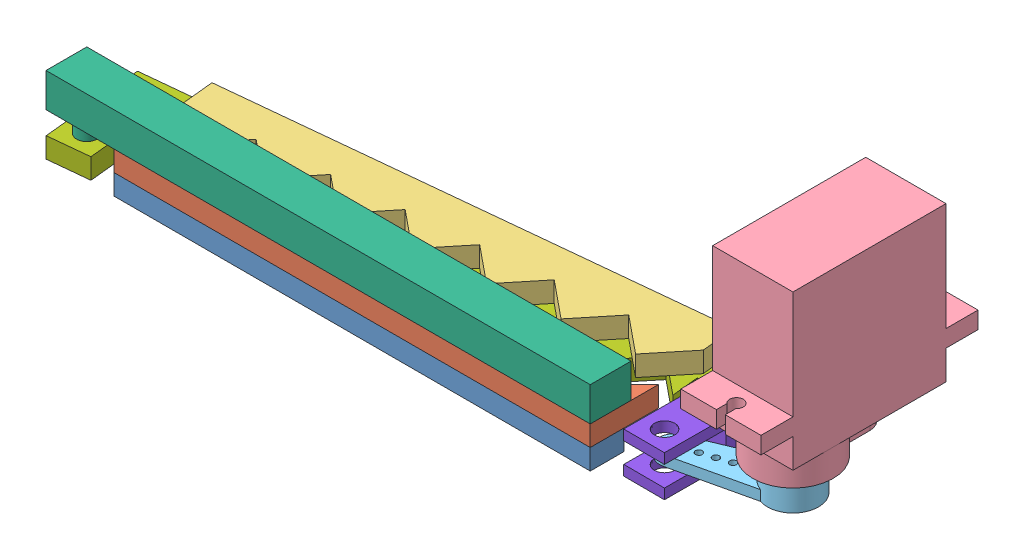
SolidWorks assembly Assem1.SLDASM, configuration Default (file format 10000). Lengths in mm.
Overall size (105.99 34.2 32.49).
9 component instances, 8 part files, 20 mates.
Components (placement in the parent):
- fixed bottom-1: fixed bottom.sldprt [Default] at origin size (70 3 10)
- fixed top-1: fixed top.sldprt [Default] at origin size (70 3 10)
- moving top-1: moving top.sldprt [Default] at (1.9909 0 16.3339) x (0.994925 0 -0.100617) z (0.100617 0 0.994925) size (70 3 10)
- SG60 Servo-1: SG60 Servo.SLDASM [Default] at (88.9 21.35 -16.25) x (0 0 -1) z (-1 0 0) size (31.9 29.9 11.8)
  - Servo-1: Servo.SLDPRT [Default] at origin size (31.9 29.9 11.8)
- Horn Servo-1: Horn Servo.SLDPRT [Default] at (88.9 5.3 -10.9) x (-0.951938 0 0.30629) z (0.30629 0 0.951938) size (19.75 4 7.5)
- holder(just so the mates can exist)-1: holder(just so the mates can exist).sldprt [Default] at (-2.1794 12 0) size (80 11 6)
- Moving Bottm-1: Moving Bottm.sldprt [Default] at (3.621 0 32.4524) x (0.994925 0 -0.100617) z (0.100617 0 0.994925) size (89 3 15)
- Coupler-1: Coupler.sldprt [Default] at (71.6269 8.6082 -7.8987) x (0.999993 0 0.003737) z (-0.003737 0 0.999993) size (6 6 20)
Mates (geometry in assembly coordinates):
- Coincident4: coincident aligned: plane of fixed bottom-1 through (0 3 -5) normal (-1 0 0); plane of fixed top-1 through (0 6 0) normal (-1 0 0)
- Coincident2: coincident anti-aligned: plane of fixed bottom-1 through (0 3 0) normal (0 1 0); plane of fixed top-1 through (0 3 0) normal (0 -1 0)
- Coincident3: coincident aligned: plane of fixed bottom-1 through (0 3 0) normal (0 0 1); plane of fixed top-1 through (0 6 0) normal (0 0 1)
- Coincident11: coincident aligned: plane of fixed top-1 through (0 6 0) normal (0 0 1); plane of holder(just so the mates can exist)-1 through (70 11 0) normal (0 0 1)
- Coincident13: coincident anti-aligned: plane of fixed top-1 through (0 6 0) normal (0 1 0); plane of holder(just so the mates can exist)-1 through (-2.1794 6 0) normal (0 -1 0)
- Coincident17: coincident anti-aligned: plane of moving top-1 through (1.9909 3 16.3339) normal (0 -1 0); plane of Moving Bottm-1 through (3.621 3 32.4524) normal (0 1 0)
- Coincident19: coincident aligned: plane of moving top-1 through (-1.2429 6 -15.6434) normal (-0.994925 0 0.100617); plane of Moving Bottm-1 through (-0.6392 3 -9.6739) normal (-0.994925 0 0.100617)
- Coincident20: coincident aligned: plane of holder(just so the mates can exist)-1 through (-5 0 87.288) normal (0 -1 0); plane of Moving Bottm-1 through (3.621 0 32.4524) normal (0 -1 0)
- Coincident21: coincident aligned: plane of moving top-1 through (-1.2429 6 -15.6434) normal (-0.100617 0 -0.994925); plane of Moving Bottm-1 through (3.7317 3 -16.1465) normal (-0.100617 0 -0.994925)
- Coincident22: coincident aligned: plane of fixed top-1 through (70 6 0) normal (1 0 0); plane of holder(just so the mates can exist)-1 through (70 11 -6) normal (1 0 0)
- Coincident23: coincident aligned: plane of fixed top-1 through (0 6 0) normal (0 0 1); plane of holder(just so the mates can exist)-1 through (70 11 0) normal (0 0 1)
- Coincident24: coincident aligned: cylinder of holder(just so the mates can exist)-1 through (-7 -4.2426 -3) axis (0 1 0) radius 1.5; circle of Moving Bottm-1
- Coincident25: coincident anti-aligned: plane of moving top-1 through (1.9909 6 16.3339) normal (0 1 0); plane of SG60 Servo-1/Servo-1 through (88.9 6 -19.7) normal (0 -1 0)
- Concentric5: concentric anti-aligned: cylinder of Moving Bottm-1 through (74.6732 3 -20.3056) axis (0 -1 0) radius 1.5; cylinder of Coupler-1 through (74.6732 -1.5 -20.3056) axis (0 1 0) radius 1.5
- Coincident26: coincident anti-aligned: plane of Moving Bottm-1 through (3.621 0 32.4524) normal (0 -1 0); plane of Coupler-1 through (77.6508 0 -14.2944) normal (0 1 0)
- Distance2: distance = 5 mm aligned: plane of SG60 Servo-1/Servo-1 through (83 32.7 -5) normal (0 0 1); plane of holder(just so the mates can exist)-1 through (70 11 0) normal (0 0 1)
- Distance1: distance = 13 mm anti-aligned: plane of SG60 Servo-1/Servo-1 through (83 21.35 -16.25) normal (-1 0 0); plane of holder(just so the mates can exist)-1 through (70 11 -6) normal (1 0 0)
- Concentric1: concentric aligned: cylinder of SG60 Servo-1/Servo-1 through (88.9 2.8 -10.9) axis (0 1 0) radius 2.3; cylinder of Horn Servo-1 through (88.9 2.8 -10.9) axis (0 1 0) radius 2.3
- Coincident1: coincident anti-aligned: plane of SG60 Servo-1/Servo-1 through (88.9 2.8 -10.9) normal (0 -1 0); plane of Horn Servo-1 through (88.9 2.8 -10.9) normal (0 1 0)
- Concentric7: concentric anti-aligned: cylinder of Horn Servo-1 through (74.6209 2.8 -6.3057) axis (0 -1 0) radius 0.5; cylinder of Coupler-1 through (74.6209 -1.5 -6.3057) axis (0 1 0) radius 1.5
